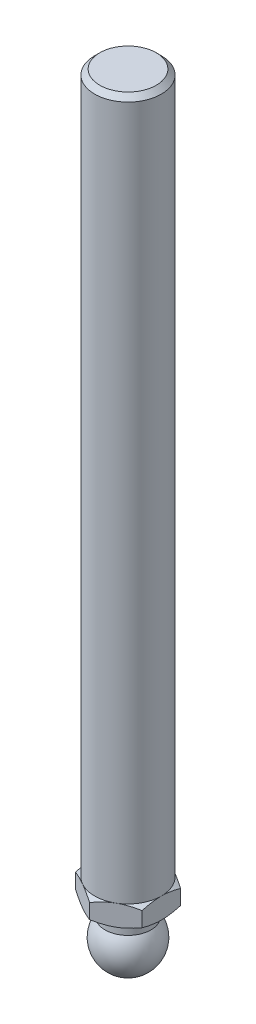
ISO-10303-21;
HEADER;
FILE_DESCRIPTION(('STEP AP214'),'2;1');
FILE_NAME('part.step','',(''),(''),'','','');
FILE_SCHEMA(('AUTOMOTIVE_DESIGN { 1 0 10303 214 1 1 1 1 }'));
ENDSEC;
DATA;
#1=APPLICATION_CONTEXT('core data for automotive mechanical design processes');
#2=APPLICATION_PROTOCOL_DEFINITION('international standard','automotive_design',2000,#1);
#3=PRODUCT_CONTEXT('',#1,'mechanical');
#4=PRODUCT('Part','Part','',(#3));
#5=PRODUCT_RELATED_PRODUCT_CATEGORY('part','',(#4));
#6=PRODUCT_DEFINITION_FORMATION('','',#4);
#7=PRODUCT_DEFINITION_CONTEXT('part definition',#1,'design');
#8=PRODUCT_DEFINITION('design','',#6,#7);
#9=PRODUCT_DEFINITION_SHAPE('','',#8);
#10=(LENGTH_UNIT() NAMED_UNIT(*) SI_UNIT(.MILLI.,.METRE.));
#11=(NAMED_UNIT(*) PLANE_ANGLE_UNIT() SI_UNIT($,.RADIAN.));
#12=(NAMED_UNIT(*) SI_UNIT($,.STERADIAN.) SOLID_ANGLE_UNIT());
#13=UNCERTAINTY_MEASURE_WITH_UNIT(LENGTH_MEASURE(1.E-05),#10,'distance_accuracy_value','');
#14=(GEOMETRIC_REPRESENTATION_CONTEXT(3) GLOBAL_UNCERTAINTY_ASSIGNED_CONTEXT((#13)) GLOBAL_UNIT_ASSIGNED_CONTEXT((#10,
#11,#12)) REPRESENTATION_CONTEXT('',''));
#15=CARTESIAN_POINT('',(0.,0.,0.));
#16=DIRECTION('',(0.,0.,1.));
#17=DIRECTION('',(1.,0.,0.));
#18=AXIS2_PLACEMENT_3D('',#15,#16,#17);
#19=CARTESIAN_POINT('',(0.,19.5,0.));
#20=DIRECTION('',(0.,-1.,0.));
#21=DIRECTION('',(0.,0.,-1.));
#22=AXIS2_PLACEMENT_3D('',#19,#20,#21);
#23=CONICAL_SURFACE('',#22,8.,1.0471975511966);
#24=CARTESIAN_POINT('',(-8.,14.714451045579,14.1889203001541));
#25=CARTESIAN_POINT('',(-8.,14.8842783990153,13.851186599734));
#26=CARTESIAN_POINT('',(-8.,15.0529801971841,13.5128811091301));
#27=CARTESIAN_POINT('',(-8.,15.3875863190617,12.8348638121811));
#28=CARTESIAN_POINT('',(-8.,15.553490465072,12.4951519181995));
#29=CARTESIAN_POINT('',(-8.,15.8822522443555,11.8134403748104));
#30=CARTESIAN_POINT('',(-8.,16.045103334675,11.4714375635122));
#31=CARTESIAN_POINT('',(-8.,16.3666666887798,10.7854960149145));
#32=CARTESIAN_POINT('',(-8.,16.5253790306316,10.4415573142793));
#33=CARTESIAN_POINT('',(-8.,16.8449502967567,9.73535271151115));
#34=CARTESIAN_POINT('',(-8.,17.0055671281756,9.37297690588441));
#35=CARTESIAN_POINT('',(-8.,17.319773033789,8.64516064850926));
#36=CARTESIAN_POINT('',(-8.,17.4733617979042,8.27972006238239));
#37=CARTESIAN_POINT('',(-8.,17.7714937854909,7.54540420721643));
#38=CARTESIAN_POINT('',(-8.,17.9160424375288,7.17653115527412));
#39=CARTESIAN_POINT('',(-8.,18.1936308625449,6.43449862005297));
#40=CARTESIAN_POINT('',(-8.,18.3266718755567,6.0613396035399));
#41=CARTESIAN_POINT('',(-8.,18.6058192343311,5.22677195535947));
#42=CARTESIAN_POINT('',(-8.,18.7482891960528,4.76412920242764));
#43=CARTESIAN_POINT('',(-8.,19.0033463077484,3.8304403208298));
#44=CARTESIAN_POINT('',(-8.,19.1159351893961,3.35939468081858));
#45=CARTESIAN_POINT('',(-8.,19.2546281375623,2.65118427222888));
#46=CARTESIAN_POINT('',(-8.,19.2955954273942,2.41690742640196));
#47=CARTESIAN_POINT('',(-8.,19.3670123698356,1.94676929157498));
#48=CARTESIAN_POINT('',(-8.,19.3974635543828,1.71090823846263));
#49=CARTESIAN_POINT('',(-8.,19.4469446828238,1.23805721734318));
#50=CARTESIAN_POINT('',(-8.,19.4659782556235,1.00106763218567));
#51=CARTESIAN_POINT('',(-8.,19.4920206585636,0.526423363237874));
#52=CARTESIAN_POINT('',(-8.,19.499029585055,0.288768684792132));
#53=CARTESIAN_POINT('',(-8.,19.5007883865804,-0.188309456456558));
#54=CARTESIAN_POINT('',(-8.,19.4954490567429,-0.427733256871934));
#55=CARTESIAN_POINT('',(-8.,19.4725128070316,-0.905988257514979));
#56=CARTESIAN_POINT('',(-8.,19.4549157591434,-1.14481945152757));
#57=CARTESIAN_POINT('',(-8.,19.4080408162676,-1.62141631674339));
#58=CARTESIAN_POINT('',(-8.,19.3787584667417,-1.85918154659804));
#59=CARTESIAN_POINT('',(-8.,19.3094074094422,-2.33311174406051));
#60=CARTESIAN_POINT('',(-8.,19.2693385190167,-2.56927668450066));
#61=CARTESIAN_POINT('',(-8.,19.1329562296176,-3.28330816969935));
#62=CARTESIAN_POINT('',(-8.,19.0213579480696,-3.75830022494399));
#63=CARTESIAN_POINT('',(-8.,18.8308759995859,-4.46428489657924));
#64=CARTESIAN_POINT('',(-8.,18.7635265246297,-4.6985528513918));
#65=CARTESIAN_POINT('',(-8.,18.6221775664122,-5.16507806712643));
#66=CARTESIAN_POINT('',(-8.,18.5481783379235,-5.39733540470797));
#67=CARTESIAN_POINT('',(-8.,18.345623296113,-6.00705809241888));
#68=CARTESIAN_POINT('',(-8.,18.2123002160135,-6.38293491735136));
#69=CARTESIAN_POINT('',(-8.,17.9338794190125,-7.13030495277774));
#70=CARTESIAN_POINT('',(-8.,17.7887803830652,-7.50179766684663));
#71=CARTESIAN_POINT('',(-8.,17.4893388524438,-8.24128843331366));
#72=CARTESIAN_POINT('',(-8.,17.3349906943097,-8.60928418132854));
#73=CARTESIAN_POINT('',(-8.,17.0191219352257,-9.34215095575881));
#74=CARTESIAN_POINT('',(-8.,16.8576016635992,-9.70702212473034));
#75=CARTESIAN_POINT('',(-8.,16.5362228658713,-10.4179250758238));
#76=CARTESIAN_POINT('',(-8.,16.3766130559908,-10.7640696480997));
#77=CARTESIAN_POINT('',(-8.,16.0531867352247,-11.4543922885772));
#78=CARTESIAN_POINT('',(-8.,15.8893701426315,-11.7985703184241));
#79=CARTESIAN_POINT('',(-8.,15.558638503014,-12.4845836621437));
#80=CARTESIAN_POINT('',(-8.,15.3917303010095,-12.8264222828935));
#81=CARTESIAN_POINT('',(-8.,15.0550779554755,-13.5086735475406));
#82=CARTESIAN_POINT('',(-8.,14.8853339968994,-13.8490862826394));
#83=CARTESIAN_POINT('',(-8.,14.714451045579,-14.1889203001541));
#84=B_SPLINE_CURVE_WITH_KNOTS('',3,(#24,#25,#26,#27,#28,#29,#30,#31,#32,#33,#34,#35,#36,#37,#38,
#39,#40,#41,#42,#43,#44,#45,#46,#47,#48,#49,#50,#51,#52,#53,#54,#55,#56,#57,#58,#59,#60,#61,#62,
#63,#64,#65,#66,#67,#68,#69,#70,#71,#72,#73,#74,#75,#76,#77,#78,#79,#80,#81,#82,#83),
.UNSPECIFIED.,.F.,.F.,(4,2,2,2,2,2,2,2,2,2,2,2,2,2,2,2,2,2,2,2,2,2,2,2,2,2,2,2,2,4),(0.,
1.13409047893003,2.26825272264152,3.40461779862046,4.54096142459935,5.73003075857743,
6.91915250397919,8.10755318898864,9.29582565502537,10.74737982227,12.1988498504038,
12.9121466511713,13.6253394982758,14.3383055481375,15.0512658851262,15.7693927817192,
16.4875271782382,17.2059355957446,17.9243561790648,19.3864869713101,20.1177019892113,
20.8488890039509,22.0450800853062,23.241405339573,24.438470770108,25.6354812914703,
26.7789606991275,27.9224623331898,29.063679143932,30.2048218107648),.UNSPECIFIED.);
#85=CARTESIAN_POINT('',(-8.,18.7854688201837,4.61880215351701));
#86=VERTEX_POINT('',#85);
#87=CARTESIAN_POINT('',(-8.,19.5,0.));
#88=VERTEX_POINT('',#87);
#89=EDGE_CURVE('E310',#86,#88,#84,.T.);
#90=ORIENTED_EDGE('',*,*,#89,.F.);
#91=CARTESIAN_POINT('',(0.0002,18.785402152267,9.23771977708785));
#92=CARTESIAN_POINT('',(-0.175648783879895,18.8440092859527,9.13619343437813));
#93=CARTESIAN_POINT('',(-0.352153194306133,18.8999565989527,9.03428856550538));
#94=CARTESIAN_POINT('',(-0.706595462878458,19.0057989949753,8.82965122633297));
#95=CARTESIAN_POINT('',(-0.88453390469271,19.0556914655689,8.72691841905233));
#96=CARTESIAN_POINT('',(-1.42119823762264,19.1953072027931,8.41707512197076));
#97=CARTESIAN_POINT('',(-1.78204258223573,19.2747188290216,8.20874154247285));
#98=CARTESIAN_POINT('',(-2.32203917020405,19.3678383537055,7.89697436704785));
#99=CARTESIAN_POINT('',(-2.49957818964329,19.3943654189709,7.79447216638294));
#100=CARTESIAN_POINT('',(-2.8554591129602,19.4388468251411,7.58900421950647));
#101=CARTESIAN_POINT('',(-3.03380094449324,19.4568019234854,7.4860385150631));
#102=CARTESIAN_POINT('',(-3.3907916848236,19.4836843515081,7.27992981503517));
#103=CARTESIAN_POINT('',(-3.56944001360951,19.4926219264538,7.17678715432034));
#104=CARTESIAN_POINT('',(-3.92690170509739,19.5012776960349,6.97040655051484));
#105=CARTESIAN_POINT('',(-4.10571506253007,19.5009961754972,6.86716861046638));
#106=CARTESIAN_POINT('',(-4.44001336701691,19.4918549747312,6.67416139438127));
#107=CARTESIAN_POINT('',(-4.59552190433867,19.4841103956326,6.58437849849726));
#108=CARTESIAN_POINT('',(-4.90617476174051,19.4617988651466,6.40502298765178));
#109=CARTESIAN_POINT('',(-5.06131905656,19.4472314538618,6.31545038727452));
#110=CARTESIAN_POINT('',(-5.52615131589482,19.3936393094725,6.04707935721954));
#111=CARTESIAN_POINT('',(-5.83501648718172,19.3447313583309,5.86875596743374));
#112=CARTESIAN_POINT('',(-6.4560232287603,19.2224605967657,5.51021755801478));
#113=CARTESIAN_POINT('',(-6.76808554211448,19.148579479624,5.33004829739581));
#114=CARTESIAN_POINT('',(-7.38755648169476,18.980899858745,4.97239658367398));
#115=CARTESIAN_POINT('',(-7.69497304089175,18.8871407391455,4.79490955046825));
#116=CARTESIAN_POINT('',(-8.0002,18.785402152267,4.61868668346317));
#117=B_SPLINE_CURVE_WITH_KNOTS('',3,(#91,#92,#93,#94,#95,#96,#97,#98,#99,#100,#101,#102,#103,
#104,#105,#106,#107,#108,#109,#110,#111,#112,#113,#114,#115,#116),.UNSPECIFIED.,.F.,.F.,(4,2,2,
2,2,2,2,2,2,2,2,2,4),(0.,0.633973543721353,1.26821965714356,2.53934712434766,3.1593434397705,
3.77928496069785,4.39852133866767,5.01773858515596,5.55680239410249,6.09590254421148,
7.17487077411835,8.27776850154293,9.37850115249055),.UNSPECIFIED.);
#118=CARTESIAN_POINT('',(-4.,19.5,6.92820323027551));
#119=VERTEX_POINT('',#118);
#120=EDGE_CURVE('E135',#119,#86,#117,.T.);
#121=ORIENTED_EDGE('',*,*,#120,.F.);
#122=CARTESIAN_POINT('',(0.,19.5,0.));
#123=DIRECTION('',(0.,-1.,0.));
#124=DIRECTION('',(0.,0.,-1.));
#125=AXIS2_PLACEMENT_3D('',#122,#123,#124);
#126=CIRCLE('',#125,8.);
#127=EDGE_CURVE('E283',#119,#88,#126,.T.);
#128=ORIENTED_EDGE('',*,*,#127,.T.);
#129=EDGE_LOOP('',(#90,#121,#128));
#130=FACE_BOUND('',#129,.T.);
#131=ADVANCED_FACE('F14',(#130),#23,.T.);
#132=CARTESIAN_POINT('',(-8.,18.7854688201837,-4.61880215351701));
#133=VERTEX_POINT('',#132);
#134=EDGE_CURVE('E193',#88,#133,#84,.T.);
#135=ORIENTED_EDGE('',*,*,#134,.F.);
#136=CARTESIAN_POINT('',(-4.,19.5,-6.92820323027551));
#137=VERTEX_POINT('',#136);
#138=EDGE_CURVE('E195',#88,#137,#126,.T.);
#139=ORIENTED_EDGE('',*,*,#138,.T.);
#140=CARTESIAN_POINT('',(-8.0002,18.785402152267,-4.61868668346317));
#141=CARTESIAN_POINT('',(-7.82435121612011,18.8440092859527,-4.72021302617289));
#142=CARTESIAN_POINT('',(-7.64784680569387,18.8999565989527,-4.82211789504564));
#143=CARTESIAN_POINT('',(-7.29340453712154,19.0057989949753,-5.02675523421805));
#144=CARTESIAN_POINT('',(-7.11546609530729,19.0556914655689,-5.12948804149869));
#145=CARTESIAN_POINT('',(-6.57880176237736,19.1953072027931,-5.43933133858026));
#146=CARTESIAN_POINT('',(-6.21795741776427,19.2747188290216,-5.64766491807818));
#147=CARTESIAN_POINT('',(-5.67796082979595,19.3678383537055,-5.95943209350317));
#148=CARTESIAN_POINT('',(-5.50042181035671,19.3943654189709,-6.06193429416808));
#149=CARTESIAN_POINT('',(-5.1445408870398,19.4388468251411,-6.26740224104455));
#150=CARTESIAN_POINT('',(-4.96619905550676,19.4568019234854,-6.37036794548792));
#151=CARTESIAN_POINT('',(-4.6092083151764,19.4836843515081,-6.57647664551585));
#152=CARTESIAN_POINT('',(-4.43055998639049,19.4926219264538,-6.67961930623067));
#153=CARTESIAN_POINT('',(-4.07309829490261,19.5012776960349,-6.88599991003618));
#154=CARTESIAN_POINT('',(-3.89428493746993,19.5009961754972,-6.98923785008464));
#155=CARTESIAN_POINT('',(-3.55998663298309,19.4918549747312,-7.18224506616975));
#156=CARTESIAN_POINT('',(-3.40447809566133,19.4841103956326,-7.27202796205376));
#157=CARTESIAN_POINT('',(-3.09382523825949,19.4617988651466,-7.45138347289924));
#158=CARTESIAN_POINT('',(-2.93868094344,19.4472314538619,-7.5409560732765));
#159=CARTESIAN_POINT('',(-2.47384868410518,19.3936393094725,-7.80932710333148));
#160=CARTESIAN_POINT('',(-2.16498351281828,19.3447313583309,-7.98765049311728));
#161=CARTESIAN_POINT('',(-1.5439767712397,19.2224605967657,-8.34618890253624));
#162=CARTESIAN_POINT('',(-1.23191445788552,19.148579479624,-8.52635816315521));
#163=CARTESIAN_POINT('',(-0.612443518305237,18.980899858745,-8.88400987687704));
#164=CARTESIAN_POINT('',(-0.305026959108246,18.8871407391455,-9.06149691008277));
#165=CARTESIAN_POINT('',(0.000200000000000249,18.785402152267,-9.23771977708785));
#166=B_SPLINE_CURVE_WITH_KNOTS('',3,(#140,#141,#142,#143,#144,#145,#146,#147,#148,#149,#150,
#151,#152,#153,#154,#155,#156,#157,#158,#159,#160,#161,#162,#163,#164,#165),.UNSPECIFIED.,.F.,
.F.,(4,2,2,2,2,2,2,2,2,2,2,2,4),(0.,0.633973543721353,1.26821965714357,2.53934712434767,
3.1593434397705,3.77928496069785,4.39852133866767,5.01773858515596,5.55680239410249,
6.09590254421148,7.17487077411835,8.27776850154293,9.37850115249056),.UNSPECIFIED.);
#167=EDGE_CURVE('E183',#133,#137,#166,.T.);
#168=ORIENTED_EDGE('',*,*,#167,.F.);
#169=EDGE_LOOP('',(#135,#139,#168));
#170=FACE_BOUND('',#169,.T.);
#171=ADVANCED_FACE('F192',(#170),#23,.T.);
#172=CARTESIAN_POINT('',(0.,18.7854688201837,-9.23760430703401));
#173=VERTEX_POINT('',#172);
#174=EDGE_CURVE('E197',#137,#173,#166,.T.);
#175=ORIENTED_EDGE('',*,*,#174,.F.);
#176=CARTESIAN_POINT('',(4.,19.5,-6.92820323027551));
#177=VERTEX_POINT('',#176);
#178=EDGE_CURVE('E290',#137,#177,#126,.T.);
#179=ORIENTED_EDGE('',*,*,#178,.T.);
#180=CARTESIAN_POINT('',(-0.0002,18.785402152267,-9.23771977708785));
#181=CARTESIAN_POINT('',(0.175648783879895,18.8440092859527,-9.13619343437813));
#182=CARTESIAN_POINT('',(0.352153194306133,18.8999565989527,-9.03428856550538));
#183=CARTESIAN_POINT('',(0.706595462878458,19.0057989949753,-8.82965122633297));
#184=CARTESIAN_POINT('',(0.88453390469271,19.0556914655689,-8.72691841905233));
#185=CARTESIAN_POINT('',(1.42119823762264,19.1953072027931,-8.41707512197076));
#186=CARTESIAN_POINT('',(1.78204258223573,19.2747188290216,-8.20874154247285));
#187=CARTESIAN_POINT('',(2.32203917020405,19.3678383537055,-7.89697436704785));
#188=CARTESIAN_POINT('',(2.49957818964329,19.3943654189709,-7.79447216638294));
#189=CARTESIAN_POINT('',(2.8554591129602,19.4388468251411,-7.58900421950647));
#190=CARTESIAN_POINT('',(3.03380094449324,19.4568019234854,-7.4860385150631));
#191=CARTESIAN_POINT('',(3.3907916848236,19.4836843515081,-7.27992981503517));
#192=CARTESIAN_POINT('',(3.56944001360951,19.4926219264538,-7.17678715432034));
#193=CARTESIAN_POINT('',(3.92690170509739,19.5012776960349,-6.97040655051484));
#194=CARTESIAN_POINT('',(4.10571506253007,19.5009961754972,-6.86716861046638));
#195=CARTESIAN_POINT('',(4.44001336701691,19.4918549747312,-6.67416139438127));
#196=CARTESIAN_POINT('',(4.59552190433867,19.4841103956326,-6.58437849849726));
#197=CARTESIAN_POINT('',(4.90617476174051,19.4617988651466,-6.40502298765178));
#198=CARTESIAN_POINT('',(5.06131905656,19.4472314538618,-6.31545038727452));
#199=CARTESIAN_POINT('',(5.52615131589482,19.3936393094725,-6.04707935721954));
#200=CARTESIAN_POINT('',(5.83501648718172,19.3447313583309,-5.86875596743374));
#201=CARTESIAN_POINT('',(6.4560232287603,19.2224605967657,-5.51021755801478));
#202=CARTESIAN_POINT('',(6.76808554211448,19.148579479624,-5.33004829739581));
#203=CARTESIAN_POINT('',(7.38755648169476,18.980899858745,-4.97239658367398));
#204=CARTESIAN_POINT('',(7.69497304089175,18.8871407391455,-4.79490955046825));
#205=CARTESIAN_POINT('',(8.0002,18.785402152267,-4.61868668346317));
#206=B_SPLINE_CURVE_WITH_KNOTS('',3,(#180,#181,#182,#183,#184,#185,#186,#187,#188,#189,#190,
#191,#192,#193,#194,#195,#196,#197,#198,#199,#200,#201,#202,#203,#204,#205),.UNSPECIFIED.,.F.,
.F.,(4,2,2,2,2,2,2,2,2,2,2,2,4),(0.,0.633973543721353,1.26821965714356,2.53934712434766,
3.1593434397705,3.77928496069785,4.39852133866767,5.01773858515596,5.55680239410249,
6.09590254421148,7.17487077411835,8.27776850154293,9.37850115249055),.UNSPECIFIED.);
#207=EDGE_CURVE('E243',#173,#177,#206,.T.);
#208=ORIENTED_EDGE('',*,*,#207,.F.);
#209=EDGE_LOOP('',(#175,#179,#208));
#210=FACE_BOUND('',#209,.T.);
#211=ADVANCED_FACE('F342',(#210),#23,.T.);
#212=CARTESIAN_POINT('',(8.,18.7854688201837,-4.61880215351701));
#213=VERTEX_POINT('',#212);
#214=EDGE_CURVE('E238',#177,#213,#206,.T.);
#215=ORIENTED_EDGE('',*,*,#214,.F.);
#216=CARTESIAN_POINT('',(8.,19.5,0.));
#217=VERTEX_POINT('',#216);
#218=EDGE_CURVE('E287',#177,#217,#126,.T.);
#219=ORIENTED_EDGE('',*,*,#218,.T.);
#220=CARTESIAN_POINT('',(8.,14.714451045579,-14.1889203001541));
#221=CARTESIAN_POINT('',(8.,14.8842783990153,-13.851186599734));
#222=CARTESIAN_POINT('',(8.,15.0529801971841,-13.5128811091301));
#223=CARTESIAN_POINT('',(8.,15.3875863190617,-12.8348638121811));
#224=CARTESIAN_POINT('',(8.,15.553490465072,-12.4951519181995));
#225=CARTESIAN_POINT('',(8.,15.8822522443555,-11.8134403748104));
#226=CARTESIAN_POINT('',(8.,16.045103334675,-11.4714375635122));
#227=CARTESIAN_POINT('',(8.,16.3666666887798,-10.7854960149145));
#228=CARTESIAN_POINT('',(8.,16.5253790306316,-10.4415573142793));
#229=CARTESIAN_POINT('',(8.,16.8449502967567,-9.73535271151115));
#230=CARTESIAN_POINT('',(8.,17.0055671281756,-9.37297690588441));
#231=CARTESIAN_POINT('',(8.,17.319773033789,-8.64516064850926));
#232=CARTESIAN_POINT('',(8.,17.4733617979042,-8.27972006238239));
#233=CARTESIAN_POINT('',(8.,17.7714937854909,-7.54540420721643));
#234=CARTESIAN_POINT('',(8.,17.9160424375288,-7.17653115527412));
#235=CARTESIAN_POINT('',(8.,18.1936308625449,-6.43449862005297));
#236=CARTESIAN_POINT('',(8.,18.3266718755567,-6.0613396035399));
#237=CARTESIAN_POINT('',(8.,18.6058192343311,-5.22677195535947));
#238=CARTESIAN_POINT('',(8.,18.7482891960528,-4.76412920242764));
#239=CARTESIAN_POINT('',(8.,19.0033463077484,-3.8304403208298));
#240=CARTESIAN_POINT('',(8.,19.1159351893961,-3.35939468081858));
#241=CARTESIAN_POINT('',(8.,19.2546281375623,-2.65118427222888));
#242=CARTESIAN_POINT('',(8.,19.2955954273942,-2.41690742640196));
#243=CARTESIAN_POINT('',(8.,19.3670123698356,-1.94676929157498));
#244=CARTESIAN_POINT('',(8.,19.3974635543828,-1.71090823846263));
#245=CARTESIAN_POINT('',(8.,19.4469446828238,-1.23805721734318));
#246=CARTESIAN_POINT('',(8.,19.4659782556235,-1.00106763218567));
#247=CARTESIAN_POINT('',(8.,19.4920206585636,-0.526423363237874));
#248=CARTESIAN_POINT('',(8.,19.499029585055,-0.288768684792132));
#249=CARTESIAN_POINT('',(8.,19.5007883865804,0.188309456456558));
#250=CARTESIAN_POINT('',(8.,19.4954490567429,0.427733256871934));
#251=CARTESIAN_POINT('',(8.,19.4725128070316,0.905988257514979));
#252=CARTESIAN_POINT('',(8.,19.4549157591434,1.14481945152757));
#253=CARTESIAN_POINT('',(8.,19.4080408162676,1.62141631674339));
#254=CARTESIAN_POINT('',(8.,19.3787584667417,1.85918154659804));
#255=CARTESIAN_POINT('',(8.,19.3094074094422,2.33311174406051));
#256=CARTESIAN_POINT('',(8.,19.2693385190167,2.56927668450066));
#257=CARTESIAN_POINT('',(8.,19.1329562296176,3.28330816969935));
#258=CARTESIAN_POINT('',(8.,19.0213579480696,3.75830022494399));
#259=CARTESIAN_POINT('',(8.,18.8308759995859,4.46428489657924));
#260=CARTESIAN_POINT('',(8.,18.7635265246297,4.6985528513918));
#261=CARTESIAN_POINT('',(8.,18.6221775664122,5.16507806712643));
#262=CARTESIAN_POINT('',(8.,18.5481783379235,5.39733540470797));
#263=CARTESIAN_POINT('',(8.,18.345623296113,6.00705809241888));
#264=CARTESIAN_POINT('',(8.,18.2123002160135,6.38293491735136));
#265=CARTESIAN_POINT('',(8.,17.9338794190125,7.13030495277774));
#266=CARTESIAN_POINT('',(8.,17.7887803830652,7.50179766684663));
#267=CARTESIAN_POINT('',(8.,17.4893388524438,8.24128843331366));
#268=CARTESIAN_POINT('',(8.,17.3349906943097,8.60928418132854));
#269=CARTESIAN_POINT('',(8.,17.0191219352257,9.34215095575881));
#270=CARTESIAN_POINT('',(8.,16.8576016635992,9.70702212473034));
#271=CARTESIAN_POINT('',(8.,16.5362228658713,10.4179250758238));
#272=CARTESIAN_POINT('',(8.,16.3766130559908,10.7640696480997));
#273=CARTESIAN_POINT('',(8.,16.0531867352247,11.4543922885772));
#274=CARTESIAN_POINT('',(8.,15.8893701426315,11.7985703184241));
#275=CARTESIAN_POINT('',(8.,15.558638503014,12.4845836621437));
#276=CARTESIAN_POINT('',(8.,15.3917303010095,12.8264222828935));
#277=CARTESIAN_POINT('',(8.,15.0550779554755,13.5086735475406));
#278=CARTESIAN_POINT('',(8.,14.8853339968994,13.8490862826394));
#279=CARTESIAN_POINT('',(8.,14.714451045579,14.1889203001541));
#280=B_SPLINE_CURVE_WITH_KNOTS('',3,(#220,#221,#222,#223,#224,#225,#226,#227,#228,#229,#230,
#231,#232,#233,#234,#235,#236,#237,#238,#239,#240,#241,#242,#243,#244,#245,#246,#247,#248,#249,
#250,#251,#252,#253,#254,#255,#256,#257,#258,#259,#260,#261,#262,#263,#264,#265,#266,#267,#268,
#269,#270,#271,#272,#273,#274,#275,#276,#277,#278,#279),.UNSPECIFIED.,.F.,.F.,(4,2,2,2,2,2,2,2,
2,2,2,2,2,2,2,2,2,2,2,2,2,2,2,2,2,2,2,2,2,4),(0.,1.13409047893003,2.26825272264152,
3.40461779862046,4.54096142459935,5.73003075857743,6.91915250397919,8.10755318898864,
9.29582565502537,10.74737982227,12.1988498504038,12.9121466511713,13.6253394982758,
14.3383055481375,15.0512658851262,15.7693927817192,16.4875271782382,17.2059355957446,
17.9243561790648,19.3864869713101,20.1177019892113,20.8488890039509,22.0450800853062,
23.241405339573,24.438470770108,25.6354812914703,26.7789606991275,27.9224623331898,
29.063679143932,30.2048218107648),.UNSPECIFIED.);
#281=EDGE_CURVE('E249',#213,#217,#280,.T.);
#282=ORIENTED_EDGE('',*,*,#281,.F.);
#283=EDGE_LOOP('',(#215,#219,#282));
#284=FACE_BOUND('',#283,.T.);
#285=ADVANCED_FACE('F352',(#284),#23,.T.);
#286=CARTESIAN_POINT('',(8.,18.7854688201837,4.61880215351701));
#287=VERTEX_POINT('',#286);
#288=EDGE_CURVE('E251',#217,#287,#280,.T.);
#289=ORIENTED_EDGE('',*,*,#288,.F.);
#290=CARTESIAN_POINT('',(4.,19.5,6.92820323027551));
#291=VERTEX_POINT('',#290);
#292=EDGE_CURVE('E281',#217,#291,#126,.T.);
#293=ORIENTED_EDGE('',*,*,#292,.T.);
#294=CARTESIAN_POINT('',(8.0002,18.785402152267,4.61868668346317));
#295=CARTESIAN_POINT('',(7.82435121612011,18.8440092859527,4.72021302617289));
#296=CARTESIAN_POINT('',(7.64784680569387,18.8999565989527,4.82211789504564));
#297=CARTESIAN_POINT('',(7.29340453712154,19.0057989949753,5.02675523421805));
#298=CARTESIAN_POINT('',(7.11546609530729,19.0556914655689,5.12948804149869));
#299=CARTESIAN_POINT('',(6.57880176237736,19.1953072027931,5.43933133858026));
#300=CARTESIAN_POINT('',(6.21795741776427,19.2747188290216,5.64766491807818));
#301=CARTESIAN_POINT('',(5.67796082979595,19.3678383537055,5.95943209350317));
#302=CARTESIAN_POINT('',(5.50042181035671,19.3943654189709,6.06193429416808));
#303=CARTESIAN_POINT('',(5.1445408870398,19.4388468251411,6.26740224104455));
#304=CARTESIAN_POINT('',(4.96619905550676,19.4568019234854,6.37036794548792));
#305=CARTESIAN_POINT('',(4.6092083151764,19.4836843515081,6.57647664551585));
#306=CARTESIAN_POINT('',(4.43055998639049,19.4926219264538,6.67961930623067));
#307=CARTESIAN_POINT('',(4.07309829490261,19.5012776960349,6.88599991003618));
#308=CARTESIAN_POINT('',(3.89428493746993,19.5009961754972,6.98923785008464));
#309=CARTESIAN_POINT('',(3.55998663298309,19.4918549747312,7.18224506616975));
#310=CARTESIAN_POINT('',(3.40447809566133,19.4841103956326,7.27202796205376));
#311=CARTESIAN_POINT('',(3.09382523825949,19.4617988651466,7.45138347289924));
#312=CARTESIAN_POINT('',(2.93868094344,19.4472314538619,7.5409560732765));
#313=CARTESIAN_POINT('',(2.47384868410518,19.3936393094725,7.80932710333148));
#314=CARTESIAN_POINT('',(2.16498351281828,19.3447313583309,7.98765049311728));
#315=CARTESIAN_POINT('',(1.5439767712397,19.2224605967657,8.34618890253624));
#316=CARTESIAN_POINT('',(1.23191445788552,19.148579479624,8.52635816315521));
#317=CARTESIAN_POINT('',(0.612443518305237,18.980899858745,8.88400987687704));
#318=CARTESIAN_POINT('',(0.305026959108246,18.8871407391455,9.06149691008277));
#319=CARTESIAN_POINT('',(-0.000200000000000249,18.785402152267,9.23771977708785));
#320=B_SPLINE_CURVE_WITH_KNOTS('',3,(#294,#295,#296,#297,#298,#299,#300,#301,#302,#303,#304,
#305,#306,#307,#308,#309,#310,#311,#312,#313,#314,#315,#316,#317,#318,#319),.UNSPECIFIED.,.F.,
.F.,(4,2,2,2,2,2,2,2,2,2,2,2,4),(0.,0.633973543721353,1.26821965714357,2.53934712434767,
3.1593434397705,3.77928496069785,4.39852133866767,5.01773858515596,5.55680239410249,
6.09590254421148,7.17487077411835,8.27776850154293,9.37850115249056),.UNSPECIFIED.);
#321=EDGE_CURVE('E126',#287,#291,#320,.T.);
#322=ORIENTED_EDGE('',*,*,#321,.F.);
#323=EDGE_LOOP('',(#289,#293,#322));
#324=FACE_BOUND('',#323,.T.);
#325=ADVANCED_FACE('F285',(#324),#23,.T.);
#326=CARTESIAN_POINT('',(0.,18.7854688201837,9.23760430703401));
#327=VERTEX_POINT('',#326);
#328=EDGE_CURVE('E116',#291,#327,#320,.T.);
#329=ORIENTED_EDGE('',*,*,#328,.F.);
#330=EDGE_CURVE('E274',#291,#119,#126,.T.);
#331=ORIENTED_EDGE('',*,*,#330,.T.);
#332=EDGE_CURVE('E29',#327,#119,#117,.T.);
#333=ORIENTED_EDGE('',*,*,#332,.F.);
#334=EDGE_LOOP('',(#329,#331,#333));
#335=FACE_BOUND('',#334,.T.);
#336=ADVANCED_FACE('F273',(#335),#23,.T.);
#337=CARTESIAN_POINT('',(0.,187.5,0.));
#338=DIRECTION('',(0.,-1.,0.));
#339=DIRECTION('',(0.,0.,-1.));
#340=AXIS2_PLACEMENT_3D('',#337,#338,#339);
#341=PLANE('',#340);
#342=CARTESIAN_POINT('',(0.,187.5,0.));
#343=DIRECTION('',(0.,-1.,0.));
#344=DIRECTION('',(0.,0.,-1.));
#345=AXIS2_PLACEMENT_3D('',#342,#343,#344);
#346=CIRCLE('',#345,6.773);
#347=CARTESIAN_POINT('',(0.,187.5,-6.773));
#348=VERTEX_POINT('',#347);
#349=EDGE_CURVE('E9',#348,#348,#346,.T.);
#350=ORIENTED_EDGE('',*,*,#349,.F.);
#351=EDGE_LOOP('',(#350));
#352=FACE_BOUND('',#351,.T.);
#353=ADVANCED_FACE('F16',(#352),#341,.F.);
#354=CARTESIAN_POINT('',(0.,187.5,0.));
#355=DIRECTION('',(0.,-1.,0.));
#356=DIRECTION('',(0.,0.,-1.));
#357=AXIS2_PLACEMENT_3D('',#354,#355,#356);
#358=CONICAL_SURFACE('',#357,6.773,0.785398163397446);
#359=CARTESIAN_POINT('',(0.,186.273,0.));
#360=DIRECTION('',(0.,-1.,0.));
#361=DIRECTION('',(0.,0.,-1.));
#362=AXIS2_PLACEMENT_3D('',#359,#360,#361);
#363=CIRCLE('',#362,8.);
#364=CARTESIAN_POINT('',(0.,186.273,-8.));
#365=VERTEX_POINT('',#364);
#366=EDGE_CURVE('E22',#365,#365,#363,.T.);
#367=ORIENTED_EDGE('',*,*,#366,.F.);
#368=EDGE_LOOP('',(#367));
#369=FACE_BOUND('',#368,.T.);
#370=ORIENTED_EDGE('',*,*,#349,.T.);
#371=EDGE_LOOP('',(#370));
#372=FACE_BOUND('',#371,.T.);
#373=ADVANCED_FACE('F350',(#369,#372),#358,.T.);
#374=CARTESIAN_POINT('',(0.,0.,0.));
#375=DIRECTION('',(0.,-1.,0.));
#376=DIRECTION('',(0.,0.,-1.));
#377=AXIS2_PLACEMENT_3D('',#374,#375,#376);
#378=CYLINDRICAL_SURFACE('',#377,8.);
#379=ORIENTED_EDGE('',*,*,#292,.F.);
#380=ORIENTED_EDGE('',*,*,#218,.F.);
#381=ORIENTED_EDGE('',*,*,#178,.F.);
#382=ORIENTED_EDGE('',*,*,#138,.F.);
#383=ORIENTED_EDGE('',*,*,#127,.F.);
#384=ORIENTED_EDGE('',*,*,#330,.F.);
#385=EDGE_LOOP('',(#379,#380,#381,#382,#383,#384));
#386=FACE_BOUND('',#385,.T.);
#387=ORIENTED_EDGE('',*,*,#366,.T.);
#388=EDGE_LOOP('',(#387));
#389=FACE_BOUND('',#388,.T.);
#390=ADVANCED_FACE('F278',(#386,#389),#378,.T.);
#391=CARTESIAN_POINT('',(-8.,14.3,-4.61880215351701));
#392=DIRECTION('',(-1.,0.,0.));
#393=DIRECTION('',(0.,0.,1.));
#394=AXIS2_PLACEMENT_3D('',#391,#392,#393);
#395=PLANE('',#394);
#396=ORIENTED_EDGE('',*,*,#89,.T.);
#397=ORIENTED_EDGE('',*,*,#134,.T.);
#398=DIRECTION('',(0.,1.,0.));
#399=VECTOR('',#398,1.);
#400=CARTESIAN_POINT('',(-8.,14.3,-4.61880215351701));
#401=LINE('',#400,#399);
#402=CARTESIAN_POINT('',(-8.,15.2145311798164,-4.61880215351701));
#403=VERTEX_POINT('',#402);
#404=EDGE_CURVE('E109',#403,#133,#401,.T.);
#405=ORIENTED_EDGE('',*,*,#404,.F.);
#406=CARTESIAN_POINT('',(-8.,19.285548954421,-14.1889203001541));
#407=CARTESIAN_POINT('',(-8.,19.1157216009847,-13.851186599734));
#408=CARTESIAN_POINT('',(-8.,18.9470198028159,-13.5128811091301));
#409=CARTESIAN_POINT('',(-8.,18.6124136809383,-12.8348638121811));
#410=CARTESIAN_POINT('',(-8.,18.446509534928,-12.4951519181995));
#411=CARTESIAN_POINT('',(-8.,18.1177477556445,-11.8134403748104));
#412=CARTESIAN_POINT('',(-8.,17.9548966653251,-11.4714375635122));
#413=CARTESIAN_POINT('',(-8.,17.6333333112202,-10.7854960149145));
#414=CARTESIAN_POINT('',(-8.,17.4746209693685,-10.4415573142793));
#415=CARTESIAN_POINT('',(-8.,17.1550497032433,-9.7353527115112));
#416=CARTESIAN_POINT('',(-8.,16.9944328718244,-9.37297690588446));
#417=CARTESIAN_POINT('',(-8.,16.680226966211,-8.64516064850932));
#418=CARTESIAN_POINT('',(-8.,16.5266382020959,-8.27972006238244));
#419=CARTESIAN_POINT('',(-8.,16.2285062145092,-7.54540420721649));
#420=CARTESIAN_POINT('',(-8.,16.0839575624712,-7.17653115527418));
#421=CARTESIAN_POINT('',(-8.,15.8063691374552,-6.43449862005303));
#422=CARTESIAN_POINT('',(-8.,15.6733281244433,-6.06133960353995));
#423=CARTESIAN_POINT('',(-8.,15.394180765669,-5.22677195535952));
#424=CARTESIAN_POINT('',(-8.,15.2517108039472,-4.7641292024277));
#425=CARTESIAN_POINT('',(-8.,14.9966536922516,-3.83044032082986));
#426=CARTESIAN_POINT('',(-8.,14.884064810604,-3.35939468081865));
#427=CARTESIAN_POINT('',(-8.,14.7453718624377,-2.65118427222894));
#428=CARTESIAN_POINT('',(-8.,14.7044045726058,-2.41690742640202));
#429=CARTESIAN_POINT('',(-8.,14.6329876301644,-1.94676929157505));
#430=CARTESIAN_POINT('',(-8.,14.6025364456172,-1.7109082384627));
#431=CARTESIAN_POINT('',(-8.,14.5530553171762,-1.23805721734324));
#432=CARTESIAN_POINT('',(-8.,14.5340217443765,-1.00106763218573));
#433=CARTESIAN_POINT('',(-8.,14.5079793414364,-0.52642336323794));
#434=CARTESIAN_POINT('',(-8.,14.500970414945,-0.288768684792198));
#435=CARTESIAN_POINT('',(-8.,14.4992116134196,0.188309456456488));
#436=CARTESIAN_POINT('',(-8.,14.5045509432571,0.427733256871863));
#437=CARTESIAN_POINT('',(-8.,14.5274871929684,0.905988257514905));
#438=CARTESIAN_POINT('',(-8.,14.5450842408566,1.1448194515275));
#439=CARTESIAN_POINT('',(-8.,14.5919591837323,1.62141631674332));
#440=CARTESIAN_POINT('',(-8.,14.6212415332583,1.85918154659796));
#441=CARTESIAN_POINT('',(-8.,14.6905925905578,2.33311174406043));
#442=CARTESIAN_POINT('',(-8.,14.7306614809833,2.56927668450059));
#443=CARTESIAN_POINT('',(-8.,14.8670437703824,3.28330816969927));
#444=CARTESIAN_POINT('',(-8.,14.9786420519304,3.75830022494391));
#445=CARTESIAN_POINT('',(-8.,15.169124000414,4.46428489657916));
#446=CARTESIAN_POINT('',(-8.,15.2364734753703,4.69855285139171));
#447=CARTESIAN_POINT('',(-8.,15.3778224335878,5.16507806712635));
#448=CARTESIAN_POINT('',(-8.,15.4518216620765,5.3973354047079));
#449=CARTESIAN_POINT('',(-8.,15.654376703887,6.0070580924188));
#450=CARTESIAN_POINT('',(-8.,15.7876997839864,6.38293491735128));
#451=CARTESIAN_POINT('',(-8.,16.0661205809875,7.13030495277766));
#452=CARTESIAN_POINT('',(-8.,16.2112196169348,7.50179766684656));
#453=CARTESIAN_POINT('',(-8.,16.5106611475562,8.2412884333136));
#454=CARTESIAN_POINT('',(-8.,16.6650093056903,8.60928418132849));
#455=CARTESIAN_POINT('',(-8.,16.9808780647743,9.34215095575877));
#456=CARTESIAN_POINT('',(-8.,17.1423983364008,9.7070221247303));
#457=CARTESIAN_POINT('',(-8.,17.4637771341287,10.4179250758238));
#458=CARTESIAN_POINT('',(-8.,17.6233869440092,10.7640696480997));
#459=CARTESIAN_POINT('',(-8.,17.9468132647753,11.4543922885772));
#460=CARTESIAN_POINT('',(-8.,18.1106298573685,11.7985703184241));
#461=CARTESIAN_POINT('',(-8.,18.441361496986,12.4845836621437));
#462=CARTESIAN_POINT('',(-8.,18.6082696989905,12.8264222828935));
#463=CARTESIAN_POINT('',(-8.,18.9449220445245,13.5086735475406));
#464=CARTESIAN_POINT('',(-8.,19.1146660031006,13.8490862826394));
#465=CARTESIAN_POINT('',(-8.,19.285548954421,14.1889203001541));
#466=B_SPLINE_CURVE_WITH_KNOTS('',3,(#406,#407,#408,#409,#410,#411,#412,#413,#414,#415,#416,
#417,#418,#419,#420,#421,#422,#423,#424,#425,#426,#427,#428,#429,#430,#431,#432,#433,#434,#435,
#436,#437,#438,#439,#440,#441,#442,#443,#444,#445,#446,#447,#448,#449,#450,#451,#452,#453,#454,
#455,#456,#457,#458,#459,#460,#461,#462,#463,#464,#465),.UNSPECIFIED.,.F.,.F.,(4,2,2,2,2,2,2,2,
2,2,2,2,2,2,2,2,2,2,2,2,2,2,2,2,2,2,2,2,2,4),(0.,1.13409047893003,2.2682527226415,
3.40461779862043,4.54096142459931,5.7300307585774,6.91915250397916,8.1075531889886,
9.29582565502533,10.7473798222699,12.1988498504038,12.9121466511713,13.6253394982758,
14.3383055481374,15.0512658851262,15.7693927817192,16.4875271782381,17.2059355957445,
17.9243561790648,19.3864869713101,20.1177019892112,20.8488890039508,22.0450800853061,
23.2414053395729,24.4384707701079,25.6354812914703,26.7789606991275,27.9224623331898,
29.063679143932,30.2048218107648),.UNSPECIFIED.);
#467=CARTESIAN_POINT('',(-8.,14.5,0.));
#468=VERTEX_POINT('',#467);
#469=EDGE_CURVE('E199',#403,#468,#466,.T.);
#470=ORIENTED_EDGE('',*,*,#469,.T.);
#471=CARTESIAN_POINT('',(-8.,15.2145311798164,4.61880215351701));
#472=VERTEX_POINT('',#471);
#473=EDGE_CURVE('E196',#468,#472,#466,.T.);
#474=ORIENTED_EDGE('',*,*,#473,.T.);
#475=DIRECTION('',(0.,1.,0.));
#476=VECTOR('',#475,1.);
#477=CARTESIAN_POINT('',(-8.,14.3,4.61880215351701));
#478=LINE('',#477,#476);
#479=EDGE_CURVE('E118',#472,#86,#478,.T.);
#480=ORIENTED_EDGE('',*,*,#479,.T.);
#481=EDGE_LOOP('',(#396,#397,#405,#470,#474,#480));
#482=FACE_BOUND('',#481,.T.);
#483=ADVANCED_FACE('F224',(#482),#395,.T.);
#484=CARTESIAN_POINT('',(0.,14.3,-9.23760430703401));
#485=DIRECTION('',(-0.5,0.,-0.866025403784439));
#486=DIRECTION('',(-0.866025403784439,0.,0.5));
#487=AXIS2_PLACEMENT_3D('',#484,#485,#486);
#488=PLANE('',#487);
#489=ORIENTED_EDGE('',*,*,#167,.T.);
#490=ORIENTED_EDGE('',*,*,#174,.T.);
#491=DIRECTION('',(0.,1.,0.));
#492=VECTOR('',#491,1.);
#493=CARTESIAN_POINT('',(0.,14.3,-9.23760430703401));
#494=LINE('',#493,#492);
#495=CARTESIAN_POINT('',(0.,15.2145311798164,-9.23760430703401));
#496=VERTEX_POINT('',#495);
#497=EDGE_CURVE('E175',#496,#173,#494,.T.);
#498=ORIENTED_EDGE('',*,*,#497,.F.);
#499=CARTESIAN_POINT('',(0.0002,15.214597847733,-9.23771977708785));
#500=CARTESIAN_POINT('',(-0.175648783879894,15.1559907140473,-9.13619343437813));
#501=CARTESIAN_POINT('',(-0.352153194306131,15.1000434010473,-9.03428856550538));
#502=CARTESIAN_POINT('',(-0.706595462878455,14.9942010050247,-8.82965122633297));
#503=CARTESIAN_POINT('',(-0.884533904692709,14.9443085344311,-8.72691841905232));
#504=CARTESIAN_POINT('',(-1.42119823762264,14.8046927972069,-8.41707512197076));
#505=CARTESIAN_POINT('',(-1.78204258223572,14.7252811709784,-8.20874154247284));
#506=CARTESIAN_POINT('',(-2.32203917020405,14.6321616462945,-7.89697436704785));
#507=CARTESIAN_POINT('',(-2.49957818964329,14.6056345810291,-7.79447216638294));
#508=CARTESIAN_POINT('',(-2.8554591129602,14.5611531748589,-7.58900421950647));
#509=CARTESIAN_POINT('',(-3.03380094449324,14.5431980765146,-7.4860385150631));
#510=CARTESIAN_POINT('',(-3.39079168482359,14.5163156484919,-7.27992981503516));
#511=CARTESIAN_POINT('',(-3.5694400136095,14.5073780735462,-7.17678715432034));
#512=CARTESIAN_POINT('',(-3.92690170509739,14.4987223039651,-6.97040655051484));
#513=CARTESIAN_POINT('',(-4.10571506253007,14.4990038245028,-6.86716861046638));
#514=CARTESIAN_POINT('',(-4.44001336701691,14.5081450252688,-6.67416139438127));
#515=CARTESIAN_POINT('',(-4.59552190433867,14.5158896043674,-6.58437849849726));
#516=CARTESIAN_POINT('',(-4.90617476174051,14.5382011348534,-6.40502298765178));
#517=CARTESIAN_POINT('',(-5.06131905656,14.5527685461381,-6.31545038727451));
#518=CARTESIAN_POINT('',(-5.52615131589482,14.6063606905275,-6.04707935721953));
#519=CARTESIAN_POINT('',(-5.83501648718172,14.6552686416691,-5.86875596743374));
#520=CARTESIAN_POINT('',(-6.4560232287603,14.7775394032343,-5.51021755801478));
#521=CARTESIAN_POINT('',(-6.76808554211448,14.851420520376,-5.3300482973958));
#522=CARTESIAN_POINT('',(-7.38755648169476,15.019100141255,-4.97239658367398));
#523=CARTESIAN_POINT('',(-7.69497304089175,15.1128592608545,-4.79490955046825));
#524=CARTESIAN_POINT('',(-8.0002,15.214597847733,-4.61868668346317));
#525=B_SPLINE_CURVE_WITH_KNOTS('',3,(#499,#500,#501,#502,#503,#504,#505,#506,#507,#508,#509,
#510,#511,#512,#513,#514,#515,#516,#517,#518,#519,#520,#521,#522,#523,#524),.UNSPECIFIED.,.F.,
.F.,(4,2,2,2,2,2,2,2,2,2,2,2,4),(0.,0.633973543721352,1.26821965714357,2.53934712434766,
3.1593434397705,3.77928496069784,4.39852133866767,5.01773858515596,5.5568023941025,
6.09590254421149,7.17487077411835,8.27776850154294,9.37850115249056),.UNSPECIFIED.);
#526=CARTESIAN_POINT('',(-4.,14.5,-6.92820323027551));
#527=VERTEX_POINT('',#526);
#528=EDGE_CURVE('E201',#496,#527,#525,.T.);
#529=ORIENTED_EDGE('',*,*,#528,.T.);
#530=EDGE_CURVE('E186',#527,#403,#525,.T.);
#531=ORIENTED_EDGE('',*,*,#530,.T.);
#532=ORIENTED_EDGE('',*,*,#404,.T.);
#533=EDGE_LOOP('',(#489,#490,#498,#529,#531,#532));
#534=FACE_BOUND('',#533,.T.);
#535=ADVANCED_FACE('F182',(#534),#488,.T.);
#536=CARTESIAN_POINT('',(8.,14.3,-4.61880215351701));
#537=DIRECTION('',(0.5,0.,-0.866025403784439));
#538=DIRECTION('',(-0.866025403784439,0.,-0.5));
#539=AXIS2_PLACEMENT_3D('',#536,#537,#538);
#540=PLANE('',#539);
#541=ORIENTED_EDGE('',*,*,#207,.T.);
#542=ORIENTED_EDGE('',*,*,#214,.T.);
#543=DIRECTION('',(0.,1.,0.));
#544=VECTOR('',#543,1.);
#545=CARTESIAN_POINT('',(8.,14.3,-4.61880215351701));
#546=LINE('',#545,#544);
#547=CARTESIAN_POINT('',(8.,15.2145311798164,-4.61880215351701));
#548=VERTEX_POINT('',#547);
#549=EDGE_CURVE('E172',#548,#213,#546,.T.);
#550=ORIENTED_EDGE('',*,*,#549,.F.);
#551=CARTESIAN_POINT('',(8.0002,15.214597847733,-4.61868668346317));
#552=CARTESIAN_POINT('',(7.82435121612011,15.1559907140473,-4.7202130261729));
#553=CARTESIAN_POINT('',(7.64784680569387,15.1000434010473,-4.82211789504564));
#554=CARTESIAN_POINT('',(7.29340453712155,14.9942010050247,-5.02675523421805));
#555=CARTESIAN_POINT('',(7.11546609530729,14.9443085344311,-5.1294880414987));
#556=CARTESIAN_POINT('',(6.57880176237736,14.8046927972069,-5.43933133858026));
#557=CARTESIAN_POINT('',(6.21795741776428,14.7252811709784,-5.64766491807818));
#558=CARTESIAN_POINT('',(5.67796082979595,14.6321616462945,-5.95943209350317));
#559=CARTESIAN_POINT('',(5.50042181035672,14.6056345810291,-6.06193429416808));
#560=CARTESIAN_POINT('',(5.1445408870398,14.5611531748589,-6.26740224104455));
#561=CARTESIAN_POINT('',(4.96619905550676,14.5431980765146,-6.37036794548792));
#562=CARTESIAN_POINT('',(4.60920831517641,14.5163156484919,-6.57647664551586));
#563=CARTESIAN_POINT('',(4.4305599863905,14.5073780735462,-6.67961930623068));
#564=CARTESIAN_POINT('',(4.07309829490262,14.4987223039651,-6.88599991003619));
#565=CARTESIAN_POINT('',(3.89428493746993,14.4990038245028,-6.98923785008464));
#566=CARTESIAN_POINT('',(3.55998663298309,14.5081450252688,-7.18224506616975));
#567=CARTESIAN_POINT('',(3.40447809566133,14.5158896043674,-7.27202796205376));
#568=CARTESIAN_POINT('',(3.09382523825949,14.5382011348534,-7.45138347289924));
#569=CARTESIAN_POINT('',(2.93868094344,14.5527685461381,-7.54095607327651));
#570=CARTESIAN_POINT('',(2.47384868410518,14.6063606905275,-7.80932710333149));
#571=CARTESIAN_POINT('',(2.16498351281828,14.6552686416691,-7.98765049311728));
#572=CARTESIAN_POINT('',(1.5439767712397,14.7775394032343,-8.34618890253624));
#573=CARTESIAN_POINT('',(1.23191445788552,14.851420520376,-8.52635816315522));
#574=CARTESIAN_POINT('',(0.612443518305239,15.019100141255,-8.88400987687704));
#575=CARTESIAN_POINT('',(0.305026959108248,15.1128592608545,-9.06149691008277));
#576=CARTESIAN_POINT('',(-0.000200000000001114,15.214597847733,-9.23771977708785));
#577=B_SPLINE_CURVE_WITH_KNOTS('',3,(#551,#552,#553,#554,#555,#556,#557,#558,#559,#560,#561,
#562,#563,#564,#565,#566,#567,#568,#569,#570,#571,#572,#573,#574,#575,#576),.UNSPECIFIED.,.F.,
.F.,(4,2,2,2,2,2,2,2,2,2,2,2,4),(0.,0.633973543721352,1.26821965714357,2.53934712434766,
3.1593434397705,3.77928496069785,4.39852133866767,5.01773858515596,5.5568023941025,
6.09590254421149,7.17487077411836,8.27776850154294,9.37850115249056),.UNSPECIFIED.);
#578=CARTESIAN_POINT('',(4.,14.5,-6.92820323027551));
#579=VERTEX_POINT('',#578);
#580=EDGE_CURVE('E244',#548,#579,#577,.T.);
#581=ORIENTED_EDGE('',*,*,#580,.T.);
#582=EDGE_CURVE('E232',#579,#496,#577,.T.);
#583=ORIENTED_EDGE('',*,*,#582,.T.);
#584=ORIENTED_EDGE('',*,*,#497,.T.);
#585=EDGE_LOOP('',(#541,#542,#550,#581,#583,#584));
#586=FACE_BOUND('',#585,.T.);
#587=ADVANCED_FACE('F223',(#586),#540,.T.);
#588=CARTESIAN_POINT('',(8.,14.3,4.61880215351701));
#589=DIRECTION('',(1.,0.,0.));
#590=DIRECTION('',(0.,0.,-1.));
#591=AXIS2_PLACEMENT_3D('',#588,#589,#590);
#592=PLANE('',#591);
#593=ORIENTED_EDGE('',*,*,#281,.T.);
#594=ORIENTED_EDGE('',*,*,#288,.T.);
#595=DIRECTION('',(0.,1.,0.));
#596=VECTOR('',#595,1.);
#597=CARTESIAN_POINT('',(8.,14.3,4.61880215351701));
#598=LINE('',#597,#596);
#599=CARTESIAN_POINT('',(8.,15.2145311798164,4.61880215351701));
#600=VERTEX_POINT('',#599);
#601=EDGE_CURVE('E117',#600,#287,#598,.T.);
#602=ORIENTED_EDGE('',*,*,#601,.F.);
#603=CARTESIAN_POINT('',(8.,19.285548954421,14.1889203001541));
#604=CARTESIAN_POINT('',(8.,19.1157216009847,13.851186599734));
#605=CARTESIAN_POINT('',(8.,18.9470198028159,13.5128811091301));
#606=CARTESIAN_POINT('',(8.,18.6124136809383,12.8348638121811));
#607=CARTESIAN_POINT('',(8.,18.446509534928,12.4951519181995));
#608=CARTESIAN_POINT('',(8.,18.1177477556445,11.8134403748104));
#609=CARTESIAN_POINT('',(8.,17.9548966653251,11.4714375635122));
#610=CARTESIAN_POINT('',(8.,17.6333333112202,10.7854960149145));
#611=CARTESIAN_POINT('',(8.,17.4746209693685,10.4415573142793));
#612=CARTESIAN_POINT('',(8.,17.1550497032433,9.7353527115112));
#613=CARTESIAN_POINT('',(8.,16.9944328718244,9.37297690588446));
#614=CARTESIAN_POINT('',(8.,16.680226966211,8.64516064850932));
#615=CARTESIAN_POINT('',(8.,16.5266382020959,8.27972006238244));
#616=CARTESIAN_POINT('',(8.,16.2285062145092,7.54540420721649));
#617=CARTESIAN_POINT('',(8.,16.0839575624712,7.17653115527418));
#618=CARTESIAN_POINT('',(8.,15.8063691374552,6.43449862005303));
#619=CARTESIAN_POINT('',(8.,15.6733281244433,6.06133960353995));
#620=CARTESIAN_POINT('',(8.,15.394180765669,5.22677195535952));
#621=CARTESIAN_POINT('',(8.,15.2517108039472,4.7641292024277));
#622=CARTESIAN_POINT('',(8.,14.9966536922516,3.83044032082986));
#623=CARTESIAN_POINT('',(8.,14.884064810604,3.35939468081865));
#624=CARTESIAN_POINT('',(8.,14.7453718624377,2.65118427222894));
#625=CARTESIAN_POINT('',(8.,14.7044045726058,2.41690742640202));
#626=CARTESIAN_POINT('',(8.,14.6329876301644,1.94676929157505));
#627=CARTESIAN_POINT('',(8.,14.6025364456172,1.7109082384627));
#628=CARTESIAN_POINT('',(8.,14.5530553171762,1.23805721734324));
#629=CARTESIAN_POINT('',(8.,14.5340217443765,1.00106763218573));
#630=CARTESIAN_POINT('',(8.,14.5079793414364,0.52642336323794));
#631=CARTESIAN_POINT('',(8.,14.500970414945,0.288768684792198));
#632=CARTESIAN_POINT('',(8.,14.4992116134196,-0.188309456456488));
#633=CARTESIAN_POINT('',(8.,14.5045509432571,-0.427733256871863));
#634=CARTESIAN_POINT('',(8.,14.5274871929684,-0.905988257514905));
#635=CARTESIAN_POINT('',(8.,14.5450842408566,-1.1448194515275));
#636=CARTESIAN_POINT('',(8.,14.5919591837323,-1.62141631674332));
#637=CARTESIAN_POINT('',(8.,14.6212415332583,-1.85918154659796));
#638=CARTESIAN_POINT('',(8.,14.6905925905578,-2.33311174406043));
#639=CARTESIAN_POINT('',(8.,14.7306614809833,-2.56927668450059));
#640=CARTESIAN_POINT('',(8.,14.8670437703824,-3.28330816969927));
#641=CARTESIAN_POINT('',(8.,14.9786420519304,-3.75830022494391));
#642=CARTESIAN_POINT('',(8.,15.169124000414,-4.46428489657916));
#643=CARTESIAN_POINT('',(8.,15.2364734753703,-4.69855285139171));
#644=CARTESIAN_POINT('',(8.,15.3778224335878,-5.16507806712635));
#645=CARTESIAN_POINT('',(8.,15.4518216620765,-5.3973354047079));
#646=CARTESIAN_POINT('',(8.,15.654376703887,-6.0070580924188));
#647=CARTESIAN_POINT('',(8.,15.7876997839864,-6.38293491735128));
#648=CARTESIAN_POINT('',(8.,16.0661205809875,-7.13030495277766));
#649=CARTESIAN_POINT('',(8.,16.2112196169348,-7.50179766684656));
#650=CARTESIAN_POINT('',(8.,16.5106611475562,-8.2412884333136));
#651=CARTESIAN_POINT('',(8.,16.6650093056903,-8.60928418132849));
#652=CARTESIAN_POINT('',(8.,16.9808780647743,-9.34215095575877));
#653=CARTESIAN_POINT('',(8.,17.1423983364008,-9.7070221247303));
#654=CARTESIAN_POINT('',(8.,17.4637771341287,-10.4179250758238));
#655=CARTESIAN_POINT('',(8.,17.6233869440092,-10.7640696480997));
#656=CARTESIAN_POINT('',(8.,17.9468132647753,-11.4543922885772));
#657=CARTESIAN_POINT('',(8.,18.1106298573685,-11.7985703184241));
#658=CARTESIAN_POINT('',(8.,18.441361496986,-12.4845836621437));
#659=CARTESIAN_POINT('',(8.,18.6082696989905,-12.8264222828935));
#660=CARTESIAN_POINT('',(8.,18.9449220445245,-13.5086735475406));
#661=CARTESIAN_POINT('',(8.,19.1146660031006,-13.8490862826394));
#662=CARTESIAN_POINT('',(8.,19.285548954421,-14.1889203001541));
#663=B_SPLINE_CURVE_WITH_KNOTS('',3,(#603,#604,#605,#606,#607,#608,#609,#610,#611,#612,#613,
#614,#615,#616,#617,#618,#619,#620,#621,#622,#623,#624,#625,#626,#627,#628,#629,#630,#631,#632,
#633,#634,#635,#636,#637,#638,#639,#640,#641,#642,#643,#644,#645,#646,#647,#648,#649,#650,#651,
#652,#653,#654,#655,#656,#657,#658,#659,#660,#661,#662),.UNSPECIFIED.,.F.,.F.,(4,2,2,2,2,2,2,2,
2,2,2,2,2,2,2,2,2,2,2,2,2,2,2,2,2,2,2,2,2,4),(0.,1.13409047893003,2.2682527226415,
3.40461779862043,4.54096142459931,5.7300307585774,6.91915250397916,8.1075531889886,
9.29582565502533,10.7473798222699,12.1988498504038,12.9121466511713,13.6253394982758,
14.3383055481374,15.0512658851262,15.7693927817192,16.4875271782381,17.2059355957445,
17.9243561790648,19.3864869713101,20.1177019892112,20.8488890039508,22.0450800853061,
23.2414053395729,24.4384707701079,25.6354812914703,26.7789606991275,27.9224623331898,
29.063679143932,30.2048218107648),.UNSPECIFIED.);
#664=CARTESIAN_POINT('',(8.,14.5,0.));
#665=VERTEX_POINT('',#664);
#666=EDGE_CURVE('E255',#600,#665,#663,.T.);
#667=ORIENTED_EDGE('',*,*,#666,.T.);
#668=EDGE_CURVE('E260',#665,#548,#663,.T.);
#669=ORIENTED_EDGE('',*,*,#668,.T.);
#670=ORIENTED_EDGE('',*,*,#549,.T.);
#671=EDGE_LOOP('',(#593,#594,#602,#667,#669,#670));
#672=FACE_BOUND('',#671,.T.);
#673=ADVANCED_FACE('F153',(#672),#592,.T.);
#674=CARTESIAN_POINT('',(0.,14.3,9.23760430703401));
#675=DIRECTION('',(0.5,0.,0.866025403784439));
#676=DIRECTION('',(0.866025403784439,0.,-0.5));
#677=AXIS2_PLACEMENT_3D('',#674,#675,#676);
#678=PLANE('',#677);
#679=ORIENTED_EDGE('',*,*,#321,.T.);
#680=ORIENTED_EDGE('',*,*,#328,.T.);
#681=DIRECTION('',(0.,1.,0.));
#682=VECTOR('',#681,1.);
#683=CARTESIAN_POINT('',(0.,14.3,9.23760430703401));
#684=LINE('',#683,#682);
#685=CARTESIAN_POINT('',(0.,15.2145311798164,9.23760430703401));
#686=VERTEX_POINT('',#685);
#687=EDGE_CURVE('E104',#686,#327,#684,.T.);
#688=ORIENTED_EDGE('',*,*,#687,.F.);
#689=CARTESIAN_POINT('',(-0.0002,15.214597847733,9.23771977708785));
#690=CARTESIAN_POINT('',(0.175648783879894,15.1559907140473,9.13619343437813));
#691=CARTESIAN_POINT('',(0.352153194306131,15.1000434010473,9.03428856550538));
#692=CARTESIAN_POINT('',(0.706595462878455,14.9942010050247,8.82965122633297));
#693=CARTESIAN_POINT('',(0.884533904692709,14.9443085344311,8.72691841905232));
#694=CARTESIAN_POINT('',(1.42119823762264,14.8046927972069,8.41707512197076));
#695=CARTESIAN_POINT('',(1.78204258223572,14.7252811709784,8.20874154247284));
#696=CARTESIAN_POINT('',(2.32203917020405,14.6321616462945,7.89697436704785));
#697=CARTESIAN_POINT('',(2.49957818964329,14.6056345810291,7.79447216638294));
#698=CARTESIAN_POINT('',(2.8554591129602,14.5611531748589,7.58900421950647));
#699=CARTESIAN_POINT('',(3.03380094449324,14.5431980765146,7.4860385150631));
#700=CARTESIAN_POINT('',(3.39079168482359,14.5163156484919,7.27992981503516));
#701=CARTESIAN_POINT('',(3.5694400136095,14.5073780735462,7.17678715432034));
#702=CARTESIAN_POINT('',(3.92690170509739,14.4987223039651,6.97040655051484));
#703=CARTESIAN_POINT('',(4.10571506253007,14.4990038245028,6.86716861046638));
#704=CARTESIAN_POINT('',(4.44001336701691,14.5081450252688,6.67416139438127));
#705=CARTESIAN_POINT('',(4.59552190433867,14.5158896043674,6.58437849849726));
#706=CARTESIAN_POINT('',(4.90617476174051,14.5382011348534,6.40502298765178));
#707=CARTESIAN_POINT('',(5.06131905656,14.5527685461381,6.31545038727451));
#708=CARTESIAN_POINT('',(5.52615131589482,14.6063606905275,6.04707935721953));
#709=CARTESIAN_POINT('',(5.83501648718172,14.6552686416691,5.86875596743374));
#710=CARTESIAN_POINT('',(6.4560232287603,14.7775394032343,5.51021755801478));
#711=CARTESIAN_POINT('',(6.76808554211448,14.851420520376,5.3300482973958));
#712=CARTESIAN_POINT('',(7.38755648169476,15.019100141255,4.97239658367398));
#713=CARTESIAN_POINT('',(7.69497304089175,15.1128592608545,4.79490955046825));
#714=CARTESIAN_POINT('',(8.0002,15.214597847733,4.61868668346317));
#715=B_SPLINE_CURVE_WITH_KNOTS('',3,(#689,#690,#691,#692,#693,#694,#695,#696,#697,#698,#699,
#700,#701,#702,#703,#704,#705,#706,#707,#708,#709,#710,#711,#712,#713,#714),.UNSPECIFIED.,.F.,
.F.,(4,2,2,2,2,2,2,2,2,2,2,2,4),(0.,0.633973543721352,1.26821965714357,2.53934712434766,
3.1593434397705,3.77928496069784,4.39852133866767,5.01773858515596,5.5568023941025,
6.09590254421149,7.17487077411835,8.27776850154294,9.37850115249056),.UNSPECIFIED.);
#716=CARTESIAN_POINT('',(4.,14.5,6.92820323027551));
#717=VERTEX_POINT('',#716);
#718=EDGE_CURVE('E113',#686,#717,#715,.T.);
#719=ORIENTED_EDGE('',*,*,#718,.T.);
#720=EDGE_CURVE('E124',#717,#600,#715,.T.);
#721=ORIENTED_EDGE('',*,*,#720,.T.);
#722=ORIENTED_EDGE('',*,*,#601,.T.);
#723=EDGE_LOOP('',(#679,#680,#688,#719,#721,#722));
#724=FACE_BOUND('',#723,.T.);
#725=ADVANCED_FACE('F112',(#724),#678,.T.);
#726=CARTESIAN_POINT('',(-8.,14.3,4.61880215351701));
#727=DIRECTION('',(-0.5,0.,0.866025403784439));
#728=DIRECTION('',(0.866025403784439,0.,0.5));
#729=AXIS2_PLACEMENT_3D('',#726,#727,#728);
#730=PLANE('',#729);
#731=ORIENTED_EDGE('',*,*,#332,.T.);
#732=ORIENTED_EDGE('',*,*,#120,.T.);
#733=ORIENTED_EDGE('',*,*,#479,.F.);
#734=CARTESIAN_POINT('',(-8.0002,15.214597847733,4.61868668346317));
#735=CARTESIAN_POINT('',(-7.82435121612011,15.1559907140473,4.7202130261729));
#736=CARTESIAN_POINT('',(-7.64784680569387,15.1000434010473,4.82211789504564));
#737=CARTESIAN_POINT('',(-7.29340453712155,14.9942010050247,5.02675523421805));
#738=CARTESIAN_POINT('',(-7.11546609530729,14.9443085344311,5.1294880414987));
#739=CARTESIAN_POINT('',(-6.57880176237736,14.8046927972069,5.43933133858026));
#740=CARTESIAN_POINT('',(-6.21795741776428,14.7252811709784,5.64766491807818));
#741=CARTESIAN_POINT('',(-5.67796082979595,14.6321616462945,5.95943209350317));
#742=CARTESIAN_POINT('',(-5.50042181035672,14.6056345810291,6.06193429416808));
#743=CARTESIAN_POINT('',(-5.1445408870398,14.5611531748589,6.26740224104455));
#744=CARTESIAN_POINT('',(-4.96619905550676,14.5431980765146,6.37036794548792));
#745=CARTESIAN_POINT('',(-4.60920831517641,14.5163156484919,6.57647664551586));
#746=CARTESIAN_POINT('',(-4.4305599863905,14.5073780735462,6.67961930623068));
#747=CARTESIAN_POINT('',(-4.07309829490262,14.4987223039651,6.88599991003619));
#748=CARTESIAN_POINT('',(-3.89428493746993,14.4990038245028,6.98923785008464));
#749=CARTESIAN_POINT('',(-3.55998663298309,14.5081450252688,7.18224506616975));
#750=CARTESIAN_POINT('',(-3.40447809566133,14.5158896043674,7.27202796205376));
#751=CARTESIAN_POINT('',(-3.09382523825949,14.5382011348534,7.45138347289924));
#752=CARTESIAN_POINT('',(-2.93868094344,14.5527685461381,7.54095607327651));
#753=CARTESIAN_POINT('',(-2.47384868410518,14.6063606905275,7.80932710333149));
#754=CARTESIAN_POINT('',(-2.16498351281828,14.6552686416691,7.98765049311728));
#755=CARTESIAN_POINT('',(-1.5439767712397,14.7775394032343,8.34618890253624));
#756=CARTESIAN_POINT('',(-1.23191445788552,14.851420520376,8.52635816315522));
#757=CARTESIAN_POINT('',(-0.612443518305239,15.019100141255,8.88400987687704));
#758=CARTESIAN_POINT('',(-0.305026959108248,15.1128592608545,9.06149691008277));
#759=CARTESIAN_POINT('',(0.000200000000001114,15.214597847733,9.23771977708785));
#760=B_SPLINE_CURVE_WITH_KNOTS('',3,(#734,#735,#736,#737,#738,#739,#740,#741,#742,#743,#744,
#745,#746,#747,#748,#749,#750,#751,#752,#753,#754,#755,#756,#757,#758,#759),.UNSPECIFIED.,.F.,
.F.,(4,2,2,2,2,2,2,2,2,2,2,2,4),(0.,0.633973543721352,1.26821965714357,2.53934712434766,
3.1593434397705,3.77928496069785,4.39852133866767,5.01773858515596,5.5568023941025,
6.09590254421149,7.17487077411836,8.27776850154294,9.37850115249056),.UNSPECIFIED.);
#761=CARTESIAN_POINT('',(-4.,14.5,6.92820323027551));
#762=VERTEX_POINT('',#761);
#763=EDGE_CURVE('E36',#472,#762,#760,.T.);
#764=ORIENTED_EDGE('',*,*,#763,.T.);
#765=EDGE_CURVE('E101',#762,#686,#760,.T.);
#766=ORIENTED_EDGE('',*,*,#765,.T.);
#767=ORIENTED_EDGE('',*,*,#687,.T.);
#768=EDGE_LOOP('',(#731,#732,#733,#764,#766,#767));
#769=FACE_BOUND('',#768,.T.);
#770=ADVANCED_FACE('F103',(#769),#730,.T.);
#771=CARTESIAN_POINT('',(0.,6.95,0.));
#772=DIRECTION('',(0.,-1.,0.));
#773=DIRECTION('',(-1.,0.,0.));
#774=AXIS2_PLACEMENT_3D('',#771,#772,#773);
#775=SPHERICAL_SURFACE('',#774,6.95);
#776=CARTESIAN_POINT('',(0.,11.1988233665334,0.));
#777=DIRECTION('',(0.,-1.,0.));
#778=DIRECTION('',(0.,0.,-1.));
#779=AXIS2_PLACEMENT_3D('',#776,#777,#778);
#780=CIRCLE('',#779,5.5);
#781=CARTESIAN_POINT('',(0.,11.1988233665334,-5.5));
#782=VERTEX_POINT('',#781);
#783=EDGE_CURVE('E306',#782,#782,#780,.T.);
#784=ORIENTED_EDGE('',*,*,#783,.T.);
#785=EDGE_LOOP('',(#784));
#786=FACE_BOUND('',#785,.T.);
#787=ADVANCED_FACE('F160',(#786),#775,.T.);
#788=CARTESIAN_POINT('',(0.,0.,0.));
#789=DIRECTION('',(0.,-1.,0.));
#790=DIRECTION('',(0.,0.,-1.));
#791=AXIS2_PLACEMENT_3D('',#788,#789,#790);
#792=CYLINDRICAL_SURFACE('',#791,5.5);
#793=ORIENTED_EDGE('',*,*,#783,.F.);
#794=EDGE_LOOP('',(#793));
#795=FACE_BOUND('',#794,.T.);
#796=CARTESIAN_POINT('',(0.,14.5,0.));
#797=DIRECTION('',(0.,-1.,0.));
#798=DIRECTION('',(0.,0.,-1.));
#799=AXIS2_PLACEMENT_3D('',#796,#797,#798);
#800=CIRCLE('',#799,5.5);
#801=CARTESIAN_POINT('',(0.,14.5,-5.5));
#802=VERTEX_POINT('',#801);
#803=EDGE_CURVE('E301',#802,#802,#800,.T.);
#804=ORIENTED_EDGE('',*,*,#803,.T.);
#805=EDGE_LOOP('',(#804));
#806=FACE_BOUND('',#805,.T.);
#807=ADVANCED_FACE('F369',(#795,#806),#792,.T.);
#808=CARTESIAN_POINT('',(0.,17.,0.));
#809=DIRECTION('',(0.,1.,0.));
#810=DIRECTION('',(0.,0.,1.));
#811=AXIS2_PLACEMENT_3D('',#808,#809,#810);
#812=CONICAL_SURFACE('',#811,12.3301270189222,1.0471975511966);
#813=ORIENTED_EDGE('',*,*,#580,.F.);
#814=ORIENTED_EDGE('',*,*,#668,.F.);
#815=CARTESIAN_POINT('',(0.,14.5,0.));
#816=DIRECTION('',(0.,-1.,0.));
#817=DIRECTION('',(0.,0.,-1.));
#818=AXIS2_PLACEMENT_3D('',#815,#816,#817);
#819=CIRCLE('',#818,8.);
#820=EDGE_CURVE('E294',#579,#665,#819,.T.);
#821=ORIENTED_EDGE('',*,*,#820,.F.);
#822=EDGE_LOOP('',(#813,#814,#821));
#823=FACE_BOUND('',#822,.T.);
#824=ADVANCED_FACE('F147',(#823),#812,.T.);
#825=ORIENTED_EDGE('',*,*,#582,.F.);
#826=EDGE_CURVE('E300',#527,#579,#819,.T.);
#827=ORIENTED_EDGE('',*,*,#826,.F.);
#828=ORIENTED_EDGE('',*,*,#528,.F.);
#829=EDGE_LOOP('',(#825,#827,#828));
#830=FACE_BOUND('',#829,.T.);
#831=ADVANCED_FACE('F366',(#830),#812,.T.);
#832=ORIENTED_EDGE('',*,*,#530,.F.);
#833=EDGE_CURVE('E304',#468,#527,#819,.T.);
#834=ORIENTED_EDGE('',*,*,#833,.F.);
#835=ORIENTED_EDGE('',*,*,#469,.F.);
#836=EDGE_LOOP('',(#832,#834,#835));
#837=FACE_BOUND('',#836,.T.);
#838=ADVANCED_FACE('F323',(#837),#812,.T.);
#839=ORIENTED_EDGE('',*,*,#473,.F.);
#840=EDGE_CURVE('E298',#762,#468,#819,.T.);
#841=ORIENTED_EDGE('',*,*,#840,.F.);
#842=ORIENTED_EDGE('',*,*,#763,.F.);
#843=EDGE_LOOP('',(#839,#841,#842));
#844=FACE_BOUND('',#843,.T.);
#845=ADVANCED_FACE('F320',(#844),#812,.T.);
#846=ORIENTED_EDGE('',*,*,#666,.F.);
#847=ORIENTED_EDGE('',*,*,#720,.F.);
#848=EDGE_CURVE('E291',#665,#717,#819,.T.);
#849=ORIENTED_EDGE('',*,*,#848,.F.);
#850=EDGE_LOOP('',(#846,#847,#849));
#851=FACE_BOUND('',#850,.T.);
#852=ADVANCED_FACE('F327',(#851),#812,.T.);
#853=CARTESIAN_POINT('',(8.,14.5,0.));
#854=DIRECTION('',(0.,1.,0.));
#855=DIRECTION('',(0.,0.,1.));
#856=AXIS2_PLACEMENT_3D('',#853,#854,#855);
#857=PLANE('',#856);
#858=ORIENTED_EDGE('',*,*,#803,.F.);
#859=EDGE_LOOP('',(#858));
#860=FACE_BOUND('',#859,.T.);
#861=ORIENTED_EDGE('',*,*,#820,.T.);
#862=ORIENTED_EDGE('',*,*,#848,.T.);
#863=EDGE_CURVE('E122',#717,#762,#819,.T.);
#864=ORIENTED_EDGE('',*,*,#863,.T.);
#865=ORIENTED_EDGE('',*,*,#840,.T.);
#866=ORIENTED_EDGE('',*,*,#833,.T.);
#867=ORIENTED_EDGE('',*,*,#826,.T.);
#868=EDGE_LOOP('',(#861,#862,#864,#865,#866,#867));
#869=FACE_BOUND('',#868,.T.);
#870=ADVANCED_FACE('F325',(#860,#869),#857,.F.);
#871=ORIENTED_EDGE('',*,*,#718,.F.);
#872=ORIENTED_EDGE('',*,*,#765,.F.);
#873=ORIENTED_EDGE('',*,*,#863,.F.);
#874=EDGE_LOOP('',(#871,#872,#873));
#875=FACE_BOUND('',#874,.T.);
#876=ADVANCED_FACE('F120',(#875),#812,.T.);
#877=CLOSED_SHELL('',(#131,#171,#211,#285,#325,#336,#353,#373,#390,#483,#535,#587,#673,#725,
#770,#787,#807,#824,#831,#838,#845,#852,#870,#876));
#878=MANIFOLD_SOLID_BREP('B1',#877);
#879=ADVANCED_BREP_SHAPE_REPRESENTATION('',(#18,#878),#14);
#880=SHAPE_DEFINITION_REPRESENTATION(#9,#879);
ENDSEC;
END-ISO-10303-21;
